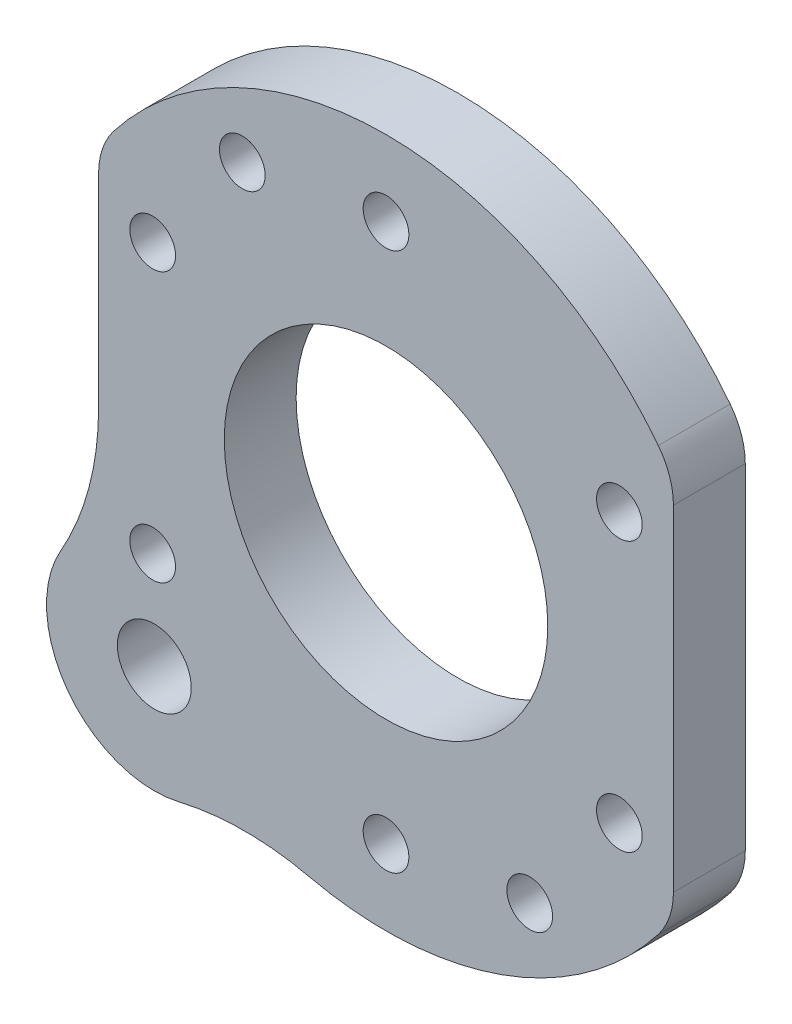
ISO-10303-21;
HEADER;
FILE_DESCRIPTION(('STEP AP214'),'2;1');
FILE_NAME('part.step','',(''),(''),'','','');
FILE_SCHEMA(('AUTOMOTIVE_DESIGN { 1 0 10303 214 1 1 1 1 }'));
ENDSEC;
DATA;
#1=APPLICATION_CONTEXT('core data for automotive mechanical design processes');
#2=APPLICATION_PROTOCOL_DEFINITION('international standard','automotive_design',2000,#1);
#3=PRODUCT_CONTEXT('',#1,'mechanical');
#4=PRODUCT('Part','Part','',(#3));
#5=PRODUCT_RELATED_PRODUCT_CATEGORY('part','',(#4));
#6=PRODUCT_DEFINITION_FORMATION('','',#4);
#7=PRODUCT_DEFINITION_CONTEXT('part definition',#1,'design');
#8=PRODUCT_DEFINITION('design','',#6,#7);
#9=PRODUCT_DEFINITION_SHAPE('','',#8);
#10=(LENGTH_UNIT() NAMED_UNIT(*) SI_UNIT(.MILLI.,.METRE.));
#11=(NAMED_UNIT(*) PLANE_ANGLE_UNIT() SI_UNIT($,.RADIAN.));
#12=(NAMED_UNIT(*) SI_UNIT($,.STERADIAN.) SOLID_ANGLE_UNIT());
#13=UNCERTAINTY_MEASURE_WITH_UNIT(LENGTH_MEASURE(1.E-05),#10,'distance_accuracy_value','');
#14=(GEOMETRIC_REPRESENTATION_CONTEXT(3) GLOBAL_UNCERTAINTY_ASSIGNED_CONTEXT((#13)) GLOBAL_UNIT_ASSIGNED_CONTEXT((#10,
#11,#12)) REPRESENTATION_CONTEXT('',''));
#15=CARTESIAN_POINT('',(0.,0.,0.));
#16=DIRECTION('',(0.,0.,1.));
#17=DIRECTION('',(1.,0.,0.));
#18=AXIS2_PLACEMENT_3D('',#15,#16,#17);
#19=CARTESIAN_POINT('',(25.4,0.,6.35));
#20=DIRECTION('',(1.,0.,0.));
#21=DIRECTION('',(0.,1.,0.));
#22=AXIS2_PLACEMENT_3D('',#19,#20,#21);
#23=PLANE('',#22);
#24=DIRECTION('',(0.,-1.,0.));
#25=VECTOR('',#24,1.);
#26=CARTESIAN_POINT('',(25.4,0.,0.));
#27=LINE('',#26,#25);
#28=CARTESIAN_POINT('',(25.4,14.8106178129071,0.));
#29=VERTEX_POINT('',#28);
#30=CARTESIAN_POINT('',(25.4,-14.8106178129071,0.));
#31=VERTEX_POINT('',#30);
#32=EDGE_CURVE('E143',#29,#31,#27,.T.);
#33=ORIENTED_EDGE('',*,*,#32,.F.);
#34=DIRECTION('',(0.,0.,1.));
#35=VECTOR('',#34,1.);
#36=CARTESIAN_POINT('',(25.4,14.8106178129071,6.35));
#37=LINE('',#36,#35);
#38=CARTESIAN_POINT('',(25.4,14.8106178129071,6.35));
#39=VERTEX_POINT('',#38);
#40=EDGE_CURVE('E121',#29,#39,#37,.T.);
#41=ORIENTED_EDGE('',*,*,#40,.T.);
#42=DIRECTION('',(0.,-1.,0.));
#43=VECTOR('',#42,1.);
#44=CARTESIAN_POINT('',(25.4,0.,6.35));
#45=LINE('',#44,#43);
#46=CARTESIAN_POINT('',(25.4,-14.8106178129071,6.35));
#47=VERTEX_POINT('',#46);
#48=EDGE_CURVE('E149',#39,#47,#45,.T.);
#49=ORIENTED_EDGE('',*,*,#48,.T.);
#50=DIRECTION('',(0.,0.,1.));
#51=VECTOR('',#50,1.);
#52=CARTESIAN_POINT('',(25.4,-14.8106178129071,0.));
#53=LINE('',#52,#51);
#54=EDGE_CURVE('E125',#47,#31,#53,.F.);
#55=ORIENTED_EDGE('',*,*,#54,.T.);
#56=EDGE_LOOP('',(#33,#41,#49,#55));
#57=FACE_BOUND('',#56,.T.);
#58=ADVANCED_FACE('F39',(#57),#23,.T.);
#59=CARTESIAN_POINT('',(0.,0.,6.35));
#60=DIRECTION('',(0.,0.,-1.));
#61=DIRECTION('',(-1.,0.,0.));
#62=AXIS2_PLACEMENT_3D('',#59,#60,#61);
#63=CYLINDRICAL_SURFACE('',#62,30.48);
#64=CARTESIAN_POINT('',(0.,0.,6.35));
#65=DIRECTION('',(0.,0.,1.));
#66=DIRECTION('',(1.,0.,0.));
#67=AXIS2_PLACEMENT_3D('',#64,#65,#66);
#68=CIRCLE('',#67,30.48);
#69=CARTESIAN_POINT('',(24.0631578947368,18.7081488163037,6.35));
#70=VERTEX_POINT('',#69);
#71=CARTESIAN_POINT('',(-24.0631578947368,18.7081488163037,6.35));
#72=VERTEX_POINT('',#71);
#73=EDGE_CURVE('E135',#70,#72,#68,.T.);
#74=ORIENTED_EDGE('',*,*,#73,.F.);
#75=DIRECTION('',(0.,0.,-1.));
#76=VECTOR('',#75,1.);
#77=CARTESIAN_POINT('',(24.0631578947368,18.7081488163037,6.35));
#78=LINE('',#77,#76);
#79=CARTESIAN_POINT('',(24.0631578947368,18.7081488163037,0.));
#80=VERTEX_POINT('',#79);
#81=EDGE_CURVE('E120',#70,#80,#78,.T.);
#82=ORIENTED_EDGE('',*,*,#81,.T.);
#83=CARTESIAN_POINT('',(0.,0.,0.));
#84=DIRECTION('',(0.,0.,1.));
#85=DIRECTION('',(1.,0.,0.));
#86=AXIS2_PLACEMENT_3D('',#83,#84,#85);
#87=CIRCLE('',#86,30.48);
#88=CARTESIAN_POINT('',(-24.0631578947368,18.7081488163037,0.));
#89=VERTEX_POINT('',#88);
#90=EDGE_CURVE('E132',#80,#89,#87,.T.);
#91=ORIENTED_EDGE('',*,*,#90,.T.);
#92=DIRECTION('',(0.,0.,-1.));
#93=VECTOR('',#92,1.);
#94=CARTESIAN_POINT('',(-24.0631578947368,18.7081488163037,6.35));
#95=LINE('',#94,#93);
#96=EDGE_CURVE('E137',#89,#72,#95,.F.);
#97=ORIENTED_EDGE('',*,*,#96,.T.);
#98=EDGE_LOOP('',(#74,#82,#91,#97));
#99=FACE_BOUND('',#98,.T.);
#100=ADVANCED_FACE('F131',(#99),#63,.T.);
#101=CARTESIAN_POINT('',(-25.4,0.,6.35));
#102=DIRECTION('',(1.,0.,0.));
#103=DIRECTION('',(0.,0.,-1.));
#104=AXIS2_PLACEMENT_3D('',#101,#102,#103);
#105=PLANE('',#104);
#106=DIRECTION('',(0.,-1.,0.));
#107=VECTOR('',#106,1.);
#108=CARTESIAN_POINT('',(-25.4,0.,0.));
#109=LINE('',#108,#107);
#110=CARTESIAN_POINT('',(-25.4,14.8106178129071,0.));
#111=VERTEX_POINT('',#110);
#112=CARTESIAN_POINT('',(-25.4,-3.15017437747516,0.));
#113=VERTEX_POINT('',#112);
#114=EDGE_CURVE('E142',#111,#113,#109,.T.);
#115=ORIENTED_EDGE('',*,*,#114,.T.);
#116=DIRECTION('',(0.,0.,-1.));
#117=VECTOR('',#116,1.);
#118=CARTESIAN_POINT('',(-25.4,-3.15017437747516,6.35));
#119=LINE('',#118,#117);
#120=CARTESIAN_POINT('',(-25.4,-3.15017437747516,6.35));
#121=VERTEX_POINT('',#120);
#122=EDGE_CURVE('E54',#113,#121,#119,.F.);
#123=ORIENTED_EDGE('',*,*,#122,.T.);
#124=DIRECTION('',(0.,-1.,0.));
#125=VECTOR('',#124,1.);
#126=CARTESIAN_POINT('',(-25.4,0.,6.35));
#127=LINE('',#126,#125);
#128=CARTESIAN_POINT('',(-25.4,14.8106178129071,6.35));
#129=VERTEX_POINT('',#128);
#130=EDGE_CURVE('E160',#129,#121,#127,.T.);
#131=ORIENTED_EDGE('',*,*,#130,.F.);
#132=DIRECTION('',(0.,0.,-1.));
#133=VECTOR('',#132,1.);
#134=CARTESIAN_POINT('',(-25.4,14.8106178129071,6.35));
#135=LINE('',#134,#133);
#136=EDGE_CURVE('E186',#129,#111,#135,.T.);
#137=ORIENTED_EDGE('',*,*,#136,.T.);
#138=EDGE_LOOP('',(#115,#123,#131,#137));
#139=FACE_BOUND('',#138,.T.);
#140=ADVANCED_FACE('F271',(#139),#105,.F.);
#141=CARTESIAN_POINT('',(-6.80256189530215,-29.7112024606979,6.35));
#142=VERTEX_POINT('',#141);
#143=CARTESIAN_POINT('',(24.0631578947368,-18.7081488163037,6.35));
#144=VERTEX_POINT('',#143);
#145=EDGE_CURVE('E162',#142,#144,#68,.T.);
#146=ORIENTED_EDGE('',*,*,#145,.F.);
#147=DIRECTION('',(0.,0.,-1.));
#148=VECTOR('',#147,1.);
#149=CARTESIAN_POINT('',(-6.80256189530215,-29.7112024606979,6.35));
#150=LINE('',#149,#148);
#151=CARTESIAN_POINT('',(-6.80256189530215,-29.7112024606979,0.));
#152=VERTEX_POINT('',#151);
#153=EDGE_CURVE('E183',#142,#152,#150,.T.);
#154=ORIENTED_EDGE('',*,*,#153,.T.);
#155=CARTESIAN_POINT('',(24.0631578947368,-18.7081488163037,0.));
#156=VERTEX_POINT('',#155);
#157=EDGE_CURVE('E145',#152,#156,#87,.T.);
#158=ORIENTED_EDGE('',*,*,#157,.T.);
#159=DIRECTION('',(0.,0.,-1.));
#160=VECTOR('',#159,1.);
#161=CARTESIAN_POINT('',(24.0631578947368,-18.7081488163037,6.35));
#162=LINE('',#161,#160);
#163=EDGE_CURVE('E202',#156,#144,#162,.F.);
#164=ORIENTED_EDGE('',*,*,#163,.T.);
#165=EDGE_LOOP('',(#146,#154,#158,#164));
#166=FACE_BOUND('',#165,.T.);
#167=ADVANCED_FACE('F200',(#166),#63,.T.);
#168=CARTESIAN_POINT('',(0.,0.,6.35));
#169=DIRECTION('',(0.,0.,1.));
#170=DIRECTION('',(1.,0.,0.));
#171=AXIS2_PLACEMENT_3D('',#168,#169,#170);
#172=PLANE('',#171);
#173=CARTESIAN_POINT('',(-12.7,21.9970452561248,6.35));
#174=DIRECTION('',(0.,0.,1.));
#175=DIRECTION('',(1.,0.,0.));
#176=AXIS2_PLACEMENT_3D('',#173,#174,#175);
#177=CIRCLE('',#176,2.01929999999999);
#178=CARTESIAN_POINT('',(-10.6807,21.9970452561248,6.35));
#179=VERTEX_POINT('',#178);
#180=EDGE_CURVE('E334',#179,#179,#177,.T.);
#181=ORIENTED_EDGE('',*,*,#180,.F.);
#182=EDGE_LOOP('',(#181));
#183=FACE_BOUND('',#182,.T.);
#184=CARTESIAN_POINT('',(12.7,-21.9970452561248,6.35));
#185=DIRECTION('',(0.,0.,1.));
#186=DIRECTION('',(1.,0.,0.));
#187=AXIS2_PLACEMENT_3D('',#184,#185,#186);
#188=CIRCLE('',#187,2.01929999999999);
#189=CARTESIAN_POINT('',(14.7192999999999,-21.9970452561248,6.35));
#190=VERTEX_POINT('',#189);
#191=EDGE_CURVE('E338',#190,#190,#188,.T.);
#192=ORIENTED_EDGE('',*,*,#191,.F.);
#193=EDGE_LOOP('',(#192));
#194=FACE_BOUND('',#193,.T.);
#195=CARTESIAN_POINT('',(0.,0.,6.35));
#196=DIRECTION('',(0.,0.,1.));
#197=DIRECTION('',(1.,0.,0.));
#198=AXIS2_PLACEMENT_3D('',#195,#196,#197);
#199=CIRCLE('',#198,14.29385);
#200=CARTESIAN_POINT('',(14.29385,0.,6.35));
#201=VERTEX_POINT('',#200);
#202=EDGE_CURVE('E342',#201,#201,#199,.T.);
#203=ORIENTED_EDGE('',*,*,#202,.F.);
#204=EDGE_LOOP('',(#203));
#205=FACE_BOUND('',#204,.T.);
#206=CARTESIAN_POINT('',(-20.4749839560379,-20.4749839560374,6.35));
#207=DIRECTION('',(0.,0.,-1.));
#208=DIRECTION('',(-1.,0.,0.));
#209=AXIS2_PLACEMENT_3D('',#206,#207,#208);
#210=CIRCLE('',#209,3.2639);
#211=CARTESIAN_POINT('',(-23.7388839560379,-20.4749839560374,6.35));
#212=VERTEX_POINT('',#211);
#213=EDGE_CURVE('E207',#212,#212,#210,.T.);
#214=ORIENTED_EDGE('',*,*,#213,.T.);
#215=EDGE_LOOP('',(#214));
#216=FACE_BOUND('',#215,.T.);
#217=CARTESIAN_POINT('',(-20.4749839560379,-20.4749839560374,6.35));
#218=DIRECTION('',(0.,0.,-1.));
#219=DIRECTION('',(-1.,0.,0.));
#220=AXIS2_PLACEMENT_3D('',#217,#218,#219);
#221=CIRCLE('',#220,9.525);
#222=CARTESIAN_POINT('',(-18.2921783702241,-29.7464986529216,6.35));
#223=VERTEX_POINT('',#222);
#224=CARTESIAN_POINT('',(-28.7454428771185,-15.7500358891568,6.35));
#225=VERTEX_POINT('',#224);
#226=EDGE_CURVE('E196',#223,#225,#221,.T.);
#227=ORIENTED_EDGE('',*,*,#226,.F.);
#228=CARTESIAN_POINT('',(-12.4713634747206,-54.4705378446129,6.35));
#229=DIRECTION('',(0.,0.,1.));
#230=DIRECTION('',(1.,0.,0.));
#231=AXIS2_PLACEMENT_3D('',#228,#229,#230);
#232=CIRCLE('',#231,25.4);
#233=EDGE_CURVE('E193',#223,#142,#232,.F.);
#234=ORIENTED_EDGE('',*,*,#233,.T.);
#235=ORIENTED_EDGE('',*,*,#145,.T.);
#236=CARTESIAN_POINT('',(19.05,-14.8106178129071,6.35));
#237=DIRECTION('',(0.,0.,1.));
#238=DIRECTION('',(1.,0.,0.));
#239=AXIS2_PLACEMENT_3D('',#236,#237,#238);
#240=CIRCLE('',#239,6.35);
#241=EDGE_CURVE('E509',#144,#47,#240,.T.);
#242=ORIENTED_EDGE('',*,*,#241,.T.);
#243=ORIENTED_EDGE('',*,*,#48,.F.);
#244=CARTESIAN_POINT('',(19.05,14.8106178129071,6.35));
#245=DIRECTION('',(0.,0.,1.));
#246=DIRECTION('',(1.,0.,0.));
#247=AXIS2_PLACEMENT_3D('',#244,#245,#246);
#248=CIRCLE('',#247,6.35);
#249=EDGE_CURVE('E505',#39,#70,#248,.T.);
#250=ORIENTED_EDGE('',*,*,#249,.T.);
#251=ORIENTED_EDGE('',*,*,#73,.T.);
#252=CARTESIAN_POINT('',(-19.05,14.8106178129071,6.35));
#253=DIRECTION('',(0.,0.,1.));
#254=DIRECTION('',(1.,0.,0.));
#255=AXIS2_PLACEMENT_3D('',#252,#253,#254);
#256=CIRCLE('',#255,6.35);
#257=EDGE_CURVE('E173',#72,#129,#256,.T.);
#258=ORIENTED_EDGE('',*,*,#257,.T.);
#259=ORIENTED_EDGE('',*,*,#130,.T.);
#260=CARTESIAN_POINT('',(-50.8,-3.15017437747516,6.35));
#261=DIRECTION('',(0.,0.,1.));
#262=DIRECTION('',(1.,0.,0.));
#263=AXIS2_PLACEMENT_3D('',#260,#261,#262);
#264=CIRCLE('',#263,25.4);
#265=EDGE_CURVE('E11',#121,#225,#264,.F.);
#266=ORIENTED_EDGE('',*,*,#265,.T.);
#267=EDGE_LOOP('',(#227,#234,#235,#242,#243,#250,#251,#258,#259,#266));
#268=FACE_BOUND('',#267,.T.);
#269=CARTESIAN_POINT('',(-20.6222299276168,11.9062500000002,6.35));
#270=DIRECTION('',(0.,0.,1.));
#271=DIRECTION('',(1.,0.,0.));
#272=AXIS2_PLACEMENT_3D('',#269,#270,#271);
#273=CIRCLE('',#272,2.01929999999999);
#274=CARTESIAN_POINT('',(-18.6029299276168,11.9062500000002,6.35));
#275=VERTEX_POINT('',#274);
#276=EDGE_CURVE('E209',#275,#275,#273,.T.);
#277=ORIENTED_EDGE('',*,*,#276,.F.);
#278=EDGE_LOOP('',(#277));
#279=FACE_BOUND('',#278,.T.);
#280=CARTESIAN_POINT('',(-20.6222299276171,-11.9062499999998,6.35));
#281=DIRECTION('',(0.,0.,1.));
#282=DIRECTION('',(1.,0.,0.));
#283=AXIS2_PLACEMENT_3D('',#280,#281,#282);
#284=CIRCLE('',#283,2.01929999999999);
#285=CARTESIAN_POINT('',(-18.6029299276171,-11.9062499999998,6.35));
#286=VERTEX_POINT('',#285);
#287=EDGE_CURVE('E220',#286,#286,#284,.T.);
#288=ORIENTED_EDGE('',*,*,#287,.F.);
#289=EDGE_LOOP('',(#288));
#290=FACE_BOUND('',#289,.T.);
#291=CARTESIAN_POINT('',(0.,-23.8125,6.35));
#292=DIRECTION('',(0.,0.,1.));
#293=DIRECTION('',(1.,0.,0.));
#294=AXIS2_PLACEMENT_3D('',#291,#292,#293);
#295=CIRCLE('',#294,2.01929999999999);
#296=CARTESIAN_POINT('',(2.01929999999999,-23.8125,6.35));
#297=VERTEX_POINT('',#296);
#298=EDGE_CURVE('E226',#297,#297,#295,.T.);
#299=ORIENTED_EDGE('',*,*,#298,.F.);
#300=EDGE_LOOP('',(#299));
#301=FACE_BOUND('',#300,.T.);
#302=CARTESIAN_POINT('',(20.6222299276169,-11.9062500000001,6.35));
#303=DIRECTION('',(0.,0.,1.));
#304=DIRECTION('',(1.,0.,0.));
#305=AXIS2_PLACEMENT_3D('',#302,#303,#304);
#306=CIRCLE('',#305,2.01929999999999);
#307=CARTESIAN_POINT('',(22.6415299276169,-11.9062500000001,6.35));
#308=VERTEX_POINT('',#307);
#309=EDGE_CURVE('E232',#308,#308,#306,.T.);
#310=ORIENTED_EDGE('',*,*,#309,.F.);
#311=EDGE_LOOP('',(#310));
#312=FACE_BOUND('',#311,.T.);
#313=CARTESIAN_POINT('',(20.622229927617,11.90625,6.35));
#314=DIRECTION('',(0.,0.,1.));
#315=DIRECTION('',(1.,0.,0.));
#316=AXIS2_PLACEMENT_3D('',#313,#314,#315);
#317=CIRCLE('',#316,2.01929999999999);
#318=CARTESIAN_POINT('',(22.641529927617,11.90625,6.35));
#319=VERTEX_POINT('',#318);
#320=EDGE_CURVE('E238',#319,#319,#317,.T.);
#321=ORIENTED_EDGE('',*,*,#320,.F.);
#322=EDGE_LOOP('',(#321));
#323=FACE_BOUND('',#322,.T.);
#324=CARTESIAN_POINT('',(0.,23.8125,6.35));
#325=DIRECTION('',(0.,0.,1.));
#326=DIRECTION('',(1.,0.,0.));
#327=AXIS2_PLACEMENT_3D('',#324,#325,#326);
#328=CIRCLE('',#327,2.01929999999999);
#329=CARTESIAN_POINT('',(2.01929999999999,23.8125,6.35));
#330=VERTEX_POINT('',#329);
#331=EDGE_CURVE('E243',#330,#330,#328,.T.);
#332=ORIENTED_EDGE('',*,*,#331,.F.);
#333=EDGE_LOOP('',(#332));
#334=FACE_BOUND('',#333,.T.);
#335=ADVANCED_FACE('F169',(#183,#194,#205,#216,#268,#279,#290,#301,#312,#323,#334),#172,.T.);
#336=CARTESIAN_POINT('',(0.,0.,0.));
#337=DIRECTION('',(0.,0.,1.));
#338=DIRECTION('',(1.,0.,0.));
#339=AXIS2_PLACEMENT_3D('',#336,#337,#338);
#340=PLANE('',#339);
#341=CARTESIAN_POINT('',(-12.7,21.9970452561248,0.));
#342=DIRECTION('',(0.,0.,1.));
#343=DIRECTION('',(1.,0.,0.));
#344=AXIS2_PLACEMENT_3D('',#341,#342,#343);
#345=CIRCLE('',#344,2.0193);
#346=CARTESIAN_POINT('',(-10.6807,21.9970452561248,0.));
#347=VERTEX_POINT('',#346);
#348=EDGE_CURVE('E357',#347,#347,#345,.T.);
#349=ORIENTED_EDGE('',*,*,#348,.T.);
#350=EDGE_LOOP('',(#349));
#351=FACE_BOUND('',#350,.T.);
#352=CARTESIAN_POINT('',(12.7,-21.9970452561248,0.));
#353=DIRECTION('',(0.,0.,1.));
#354=DIRECTION('',(1.,0.,0.));
#355=AXIS2_PLACEMENT_3D('',#352,#353,#354);
#356=CIRCLE('',#355,2.0193);
#357=CARTESIAN_POINT('',(14.7193,-21.9970452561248,0.));
#358=VERTEX_POINT('',#357);
#359=EDGE_CURVE('E345',#358,#358,#356,.T.);
#360=ORIENTED_EDGE('',*,*,#359,.T.);
#361=EDGE_LOOP('',(#360));
#362=FACE_BOUND('',#361,.T.);
#363=CARTESIAN_POINT('',(0.,0.,0.));
#364=DIRECTION('',(0.,0.,1.));
#365=DIRECTION('',(1.,0.,0.));
#366=AXIS2_PLACEMENT_3D('',#363,#364,#365);
#367=CIRCLE('',#366,14.29385);
#368=CARTESIAN_POINT('',(14.29385,0.,0.));
#369=VERTEX_POINT('',#368);
#370=EDGE_CURVE('E344',#369,#369,#367,.T.);
#371=ORIENTED_EDGE('',*,*,#370,.T.);
#372=EDGE_LOOP('',(#371));
#373=FACE_BOUND('',#372,.T.);
#374=CARTESIAN_POINT('',(-20.4749839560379,-20.4749839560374,0.));
#375=DIRECTION('',(0.,0.,-1.));
#376=DIRECTION('',(-1.,0.,0.));
#377=AXIS2_PLACEMENT_3D('',#374,#375,#376);
#378=CIRCLE('',#377,3.2639);
#379=CARTESIAN_POINT('',(-23.7388839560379,-20.4749839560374,0.));
#380=VERTEX_POINT('',#379);
#381=EDGE_CURVE('E212',#380,#380,#378,.T.);
#382=ORIENTED_EDGE('',*,*,#381,.F.);
#383=EDGE_LOOP('',(#382));
#384=FACE_BOUND('',#383,.T.);
#385=ORIENTED_EDGE('',*,*,#157,.F.);
#386=CARTESIAN_POINT('',(-12.4713634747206,-54.4705378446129,0.));
#387=DIRECTION('',(0.,0.,1.));
#388=DIRECTION('',(1.,0.,0.));
#389=AXIS2_PLACEMENT_3D('',#386,#387,#388);
#390=CIRCLE('',#389,25.4);
#391=CARTESIAN_POINT('',(-18.2921783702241,-29.7464986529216,0.));
#392=VERTEX_POINT('',#391);
#393=EDGE_CURVE('E191',#152,#392,#390,.T.);
#394=ORIENTED_EDGE('',*,*,#393,.T.);
#395=CARTESIAN_POINT('',(-20.4749839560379,-20.4749839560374,0.));
#396=DIRECTION('',(0.,0.,-1.));
#397=DIRECTION('',(-1.,0.,0.));
#398=AXIS2_PLACEMENT_3D('',#395,#396,#397);
#399=CIRCLE('',#398,9.525);
#400=CARTESIAN_POINT('',(-28.7454428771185,-15.7500358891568,0.));
#401=VERTEX_POINT('',#400);
#402=EDGE_CURVE('E205',#392,#401,#399,.T.);
#403=ORIENTED_EDGE('',*,*,#402,.T.);
#404=CARTESIAN_POINT('',(-50.8,-3.15017437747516,0.));
#405=DIRECTION('',(0.,0.,1.));
#406=DIRECTION('',(1.,0.,0.));
#407=AXIS2_PLACEMENT_3D('',#404,#405,#406);
#408=CIRCLE('',#407,25.4);
#409=EDGE_CURVE('E47',#401,#113,#408,.T.);
#410=ORIENTED_EDGE('',*,*,#409,.T.);
#411=ORIENTED_EDGE('',*,*,#114,.F.);
#412=CARTESIAN_POINT('',(-19.05,14.8106178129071,0.));
#413=DIRECTION('',(0.,0.,1.));
#414=DIRECTION('',(1.,0.,0.));
#415=AXIS2_PLACEMENT_3D('',#412,#413,#414);
#416=CIRCLE('',#415,6.35);
#417=EDGE_CURVE('E136',#111,#89,#416,.F.);
#418=ORIENTED_EDGE('',*,*,#417,.T.);
#419=ORIENTED_EDGE('',*,*,#90,.F.);
#420=CARTESIAN_POINT('',(19.05,14.8106178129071,0.));
#421=DIRECTION('',(0.,0.,1.));
#422=DIRECTION('',(1.,0.,0.));
#423=AXIS2_PLACEMENT_3D('',#420,#421,#422);
#424=CIRCLE('',#423,6.35);
#425=EDGE_CURVE('E116',#80,#29,#424,.F.);
#426=ORIENTED_EDGE('',*,*,#425,.T.);
#427=ORIENTED_EDGE('',*,*,#32,.T.);
#428=CARTESIAN_POINT('',(19.05,-14.8106178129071,0.));
#429=DIRECTION('',(0.,0.,1.));
#430=DIRECTION('',(1.,0.,0.));
#431=AXIS2_PLACEMENT_3D('',#428,#429,#430);
#432=CIRCLE('',#431,6.35);
#433=EDGE_CURVE('E126',#31,#156,#432,.F.);
#434=ORIENTED_EDGE('',*,*,#433,.T.);
#435=EDGE_LOOP('',(#385,#394,#403,#410,#411,#418,#419,#426,#427,#434));
#436=FACE_BOUND('',#435,.T.);
#437=CARTESIAN_POINT('',(-20.6222299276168,11.9062500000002,0.));
#438=DIRECTION('',(0.,0.,1.));
#439=DIRECTION('',(1.,0.,0.));
#440=AXIS2_PLACEMENT_3D('',#437,#438,#439);
#441=CIRCLE('',#440,2.0193);
#442=CARTESIAN_POINT('',(-18.6029299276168,11.9062500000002,0.));
#443=VERTEX_POINT('',#442);
#444=EDGE_CURVE('E217',#443,#443,#441,.T.);
#445=ORIENTED_EDGE('',*,*,#444,.T.);
#446=EDGE_LOOP('',(#445));
#447=FACE_BOUND('',#446,.T.);
#448=CARTESIAN_POINT('',(-20.6222299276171,-11.9062499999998,0.));
#449=DIRECTION('',(0.,0.,1.));
#450=DIRECTION('',(1.,0.,0.));
#451=AXIS2_PLACEMENT_3D('',#448,#449,#450);
#452=CIRCLE('',#451,2.0193);
#453=CARTESIAN_POINT('',(-18.6029299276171,-11.9062499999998,0.));
#454=VERTEX_POINT('',#453);
#455=EDGE_CURVE('E223',#454,#454,#452,.T.);
#456=ORIENTED_EDGE('',*,*,#455,.T.);
#457=EDGE_LOOP('',(#456));
#458=FACE_BOUND('',#457,.T.);
#459=CARTESIAN_POINT('',(0.,-23.8125,0.));
#460=DIRECTION('',(0.,0.,1.));
#461=DIRECTION('',(1.,0.,0.));
#462=AXIS2_PLACEMENT_3D('',#459,#460,#461);
#463=CIRCLE('',#462,2.0193);
#464=CARTESIAN_POINT('',(2.0193,-23.8125,0.));
#465=VERTEX_POINT('',#464);
#466=EDGE_CURVE('E229',#465,#465,#463,.T.);
#467=ORIENTED_EDGE('',*,*,#466,.T.);
#468=EDGE_LOOP('',(#467));
#469=FACE_BOUND('',#468,.T.);
#470=CARTESIAN_POINT('',(20.6222299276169,-11.9062500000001,0.));
#471=DIRECTION('',(0.,0.,1.));
#472=DIRECTION('',(1.,0.,0.));
#473=AXIS2_PLACEMENT_3D('',#470,#471,#472);
#474=CIRCLE('',#473,2.0193);
#475=CARTESIAN_POINT('',(22.6415299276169,-11.9062500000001,0.));
#476=VERTEX_POINT('',#475);
#477=EDGE_CURVE('E235',#476,#476,#474,.T.);
#478=ORIENTED_EDGE('',*,*,#477,.T.);
#479=EDGE_LOOP('',(#478));
#480=FACE_BOUND('',#479,.T.);
#481=CARTESIAN_POINT('',(20.622229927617,11.90625,0.));
#482=DIRECTION('',(0.,0.,1.));
#483=DIRECTION('',(1.,0.,0.));
#484=AXIS2_PLACEMENT_3D('',#481,#482,#483);
#485=CIRCLE('',#484,2.0193);
#486=CARTESIAN_POINT('',(22.641529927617,11.90625,0.));
#487=VERTEX_POINT('',#486);
#488=EDGE_CURVE('E241',#487,#487,#485,.T.);
#489=ORIENTED_EDGE('',*,*,#488,.T.);
#490=EDGE_LOOP('',(#489));
#491=FACE_BOUND('',#490,.T.);
#492=CARTESIAN_POINT('',(0.,23.8125,0.));
#493=DIRECTION('',(0.,0.,1.));
#494=DIRECTION('',(1.,0.,0.));
#495=AXIS2_PLACEMENT_3D('',#492,#493,#494);
#496=CIRCLE('',#495,2.0193);
#497=CARTESIAN_POINT('',(2.0193,23.8125,0.));
#498=VERTEX_POINT('',#497);
#499=EDGE_CURVE('E147',#498,#498,#496,.T.);
#500=ORIENTED_EDGE('',*,*,#499,.T.);
#501=EDGE_LOOP('',(#500));
#502=FACE_BOUND('',#501,.T.);
#503=ADVANCED_FACE('F140',(#351,#362,#373,#384,#436,#447,#458,#469,#480,#491,#502),#340,.F.);
#504=CARTESIAN_POINT('',(0.,23.8125,6.35));
#505=DIRECTION('',(0.,0.,1.));
#506=DIRECTION('',(1.,0.,0.));
#507=AXIS2_PLACEMENT_3D('',#504,#505,#506);
#508=CYLINDRICAL_SURFACE('',#507,2.01929999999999);
#509=ORIENTED_EDGE('',*,*,#499,.F.);
#510=EDGE_LOOP('',(#509));
#511=FACE_BOUND('',#510,.T.);
#512=ORIENTED_EDGE('',*,*,#331,.T.);
#513=EDGE_LOOP('',(#512));
#514=FACE_BOUND('',#513,.T.);
#515=ADVANCED_FACE('F251',(#511,#514),#508,.F.);
#516=CARTESIAN_POINT('',(20.622229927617,11.90625,6.35));
#517=DIRECTION('',(0.,0.,1.));
#518=DIRECTION('',(1.,0.,0.));
#519=AXIS2_PLACEMENT_3D('',#516,#517,#518);
#520=CYLINDRICAL_SURFACE('',#519,2.01929999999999);
#521=ORIENTED_EDGE('',*,*,#488,.F.);
#522=EDGE_LOOP('',(#521));
#523=FACE_BOUND('',#522,.T.);
#524=ORIENTED_EDGE('',*,*,#320,.T.);
#525=EDGE_LOOP('',(#524));
#526=FACE_BOUND('',#525,.T.);
#527=ADVANCED_FACE('F253',(#523,#526),#520,.F.);
#528=CARTESIAN_POINT('',(20.6222299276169,-11.9062500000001,6.35));
#529=DIRECTION('',(0.,0.,1.));
#530=DIRECTION('',(1.,0.,0.));
#531=AXIS2_PLACEMENT_3D('',#528,#529,#530);
#532=CYLINDRICAL_SURFACE('',#531,2.01929999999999);
#533=ORIENTED_EDGE('',*,*,#477,.F.);
#534=EDGE_LOOP('',(#533));
#535=FACE_BOUND('',#534,.T.);
#536=ORIENTED_EDGE('',*,*,#309,.T.);
#537=EDGE_LOOP('',(#536));
#538=FACE_BOUND('',#537,.T.);
#539=ADVANCED_FACE('F259',(#535,#538),#532,.F.);
#540=CARTESIAN_POINT('',(0.,-23.8125,6.35));
#541=DIRECTION('',(0.,0.,1.));
#542=DIRECTION('',(1.,0.,0.));
#543=AXIS2_PLACEMENT_3D('',#540,#541,#542);
#544=CYLINDRICAL_SURFACE('',#543,2.01929999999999);
#545=ORIENTED_EDGE('',*,*,#466,.F.);
#546=EDGE_LOOP('',(#545));
#547=FACE_BOUND('',#546,.T.);
#548=ORIENTED_EDGE('',*,*,#298,.T.);
#549=EDGE_LOOP('',(#548));
#550=FACE_BOUND('',#549,.T.);
#551=ADVANCED_FACE('F309',(#547,#550),#544,.F.);
#552=CARTESIAN_POINT('',(-20.6222299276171,-11.9062499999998,6.35));
#553=DIRECTION('',(0.,0.,1.));
#554=DIRECTION('',(1.,0.,0.));
#555=AXIS2_PLACEMENT_3D('',#552,#553,#554);
#556=CYLINDRICAL_SURFACE('',#555,2.01929999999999);
#557=ORIENTED_EDGE('',*,*,#455,.F.);
#558=EDGE_LOOP('',(#557));
#559=FACE_BOUND('',#558,.T.);
#560=ORIENTED_EDGE('',*,*,#287,.T.);
#561=EDGE_LOOP('',(#560));
#562=FACE_BOUND('',#561,.T.);
#563=ADVANCED_FACE('F305',(#559,#562),#556,.F.);
#564=CARTESIAN_POINT('',(-20.6222299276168,11.9062500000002,6.35));
#565=DIRECTION('',(0.,0.,1.));
#566=DIRECTION('',(1.,0.,0.));
#567=AXIS2_PLACEMENT_3D('',#564,#565,#566);
#568=CYLINDRICAL_SURFACE('',#567,2.01929999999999);
#569=ORIENTED_EDGE('',*,*,#444,.F.);
#570=EDGE_LOOP('',(#569));
#571=FACE_BOUND('',#570,.T.);
#572=ORIENTED_EDGE('',*,*,#276,.T.);
#573=EDGE_LOOP('',(#572));
#574=FACE_BOUND('',#573,.T.);
#575=ADVANCED_FACE('F278',(#571,#574),#568,.F.);
#576=CARTESIAN_POINT('',(19.05,14.8106178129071,6.35));
#577=DIRECTION('',(0.,0.,-1.));
#578=DIRECTION('',(-1.,0.,0.));
#579=AXIS2_PLACEMENT_3D('',#576,#577,#578);
#580=CYLINDRICAL_SURFACE('',#579,6.35);
#581=ORIENTED_EDGE('',*,*,#249,.F.);
#582=ORIENTED_EDGE('',*,*,#40,.F.);
#583=ORIENTED_EDGE('',*,*,#425,.F.);
#584=ORIENTED_EDGE('',*,*,#81,.F.);
#585=EDGE_LOOP('',(#581,#582,#583,#584));
#586=FACE_BOUND('',#585,.T.);
#587=ADVANCED_FACE('F119',(#586),#580,.T.);
#588=CARTESIAN_POINT('',(19.05,-14.8106178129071,6.35));
#589=DIRECTION('',(0.,0.,-1.));
#590=DIRECTION('',(-1.,0.,0.));
#591=AXIS2_PLACEMENT_3D('',#588,#589,#590);
#592=CYLINDRICAL_SURFACE('',#591,6.35);
#593=ORIENTED_EDGE('',*,*,#241,.F.);
#594=ORIENTED_EDGE('',*,*,#163,.F.);
#595=ORIENTED_EDGE('',*,*,#433,.F.);
#596=ORIENTED_EDGE('',*,*,#54,.F.);
#597=EDGE_LOOP('',(#593,#594,#595,#596));
#598=FACE_BOUND('',#597,.T.);
#599=ADVANCED_FACE('F277',(#598),#592,.T.);
#600=CARTESIAN_POINT('',(-19.05,14.8106178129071,6.35));
#601=DIRECTION('',(0.,0.,-1.));
#602=DIRECTION('',(-1.,0.,0.));
#603=AXIS2_PLACEMENT_3D('',#600,#601,#602);
#604=CYLINDRICAL_SURFACE('',#603,6.35);
#605=ORIENTED_EDGE('',*,*,#257,.F.);
#606=ORIENTED_EDGE('',*,*,#96,.F.);
#607=ORIENTED_EDGE('',*,*,#417,.F.);
#608=ORIENTED_EDGE('',*,*,#136,.F.);
#609=EDGE_LOOP('',(#605,#606,#607,#608));
#610=FACE_BOUND('',#609,.T.);
#611=ADVANCED_FACE('F281',(#610),#604,.T.);
#612=CARTESIAN_POINT('',(-20.4749839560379,-20.4749839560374,6.35));
#613=DIRECTION('',(0.,0.,-1.));
#614=DIRECTION('',(-1.,0.,0.));
#615=AXIS2_PLACEMENT_3D('',#612,#613,#614);
#616=CYLINDRICAL_SURFACE('',#615,9.525);
#617=ORIENTED_EDGE('',*,*,#402,.F.);
#618=DIRECTION('',(0.,0.,-1.));
#619=VECTOR('',#618,1.);
#620=CARTESIAN_POINT('',(-18.2921783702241,-29.7464986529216,6.35));
#621=LINE('',#620,#619);
#622=EDGE_CURVE('E182',#392,#223,#621,.F.);
#623=ORIENTED_EDGE('',*,*,#622,.T.);
#624=ORIENTED_EDGE('',*,*,#226,.T.);
#625=DIRECTION('',(0.,0.,-1.));
#626=VECTOR('',#625,1.);
#627=CARTESIAN_POINT('',(-28.7454428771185,-15.7500358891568,6.35));
#628=LINE('',#627,#626);
#629=EDGE_CURVE('E179',#225,#401,#628,.T.);
#630=ORIENTED_EDGE('',*,*,#629,.T.);
#631=EDGE_LOOP('',(#617,#623,#624,#630));
#632=FACE_BOUND('',#631,.T.);
#633=ADVANCED_FACE('F206',(#632),#616,.T.);
#634=CARTESIAN_POINT('',(-20.4749839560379,-20.4749839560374,0.));
#635=DIRECTION('',(0.,0.,-1.));
#636=DIRECTION('',(-1.,0.,0.));
#637=AXIS2_PLACEMENT_3D('',#634,#635,#636);
#638=CYLINDRICAL_SURFACE('',#637,3.2639);
#639=ORIENTED_EDGE('',*,*,#213,.F.);
#640=EDGE_LOOP('',(#639));
#641=FACE_BOUND('',#640,.T.);
#642=ORIENTED_EDGE('',*,*,#381,.T.);
#643=EDGE_LOOP('',(#642));
#644=FACE_BOUND('',#643,.T.);
#645=ADVANCED_FACE('F286',(#641,#644),#638,.F.);
#646=CARTESIAN_POINT('',(-12.4713634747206,-54.4705378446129,6.35));
#647=DIRECTION('',(0.,0.,1.));
#648=DIRECTION('',(1.,0.,0.));
#649=AXIS2_PLACEMENT_3D('',#646,#647,#648);
#650=CYLINDRICAL_SURFACE('',#649,25.4);
#651=ORIENTED_EDGE('',*,*,#233,.F.);
#652=ORIENTED_EDGE('',*,*,#622,.F.);
#653=ORIENTED_EDGE('',*,*,#393,.F.);
#654=ORIENTED_EDGE('',*,*,#153,.F.);
#655=EDGE_LOOP('',(#651,#652,#653,#654));
#656=FACE_BOUND('',#655,.T.);
#657=ADVANCED_FACE('F204',(#656),#650,.F.);
#658=CARTESIAN_POINT('',(-50.8,-3.15017437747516,6.35));
#659=DIRECTION('',(0.,0.,-1.));
#660=DIRECTION('',(-1.,0.,0.));
#661=AXIS2_PLACEMENT_3D('',#658,#659,#660);
#662=CYLINDRICAL_SURFACE('',#661,25.4);
#663=ORIENTED_EDGE('',*,*,#265,.F.);
#664=ORIENTED_EDGE('',*,*,#122,.F.);
#665=ORIENTED_EDGE('',*,*,#409,.F.);
#666=ORIENTED_EDGE('',*,*,#629,.F.);
#667=EDGE_LOOP('',(#663,#664,#665,#666));
#668=FACE_BOUND('',#667,.T.);
#669=ADVANCED_FACE('F41',(#668),#662,.F.);
#670=CARTESIAN_POINT('',(0.,0.,0.));
#671=DIRECTION('',(0.,0.,1.));
#672=DIRECTION('',(1.,0.,0.));
#673=AXIS2_PLACEMENT_3D('',#670,#671,#672);
#674=CYLINDRICAL_SURFACE('',#673,14.29385);
#675=ORIENTED_EDGE('',*,*,#370,.F.);
#676=EDGE_LOOP('',(#675));
#677=FACE_BOUND('',#676,.T.);
#678=ORIENTED_EDGE('',*,*,#202,.T.);
#679=EDGE_LOOP('',(#678));
#680=FACE_BOUND('',#679,.T.);
#681=ADVANCED_FACE('F291',(#677,#680),#674,.F.);
#682=CARTESIAN_POINT('',(12.7,-21.9970452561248,6.35));
#683=DIRECTION('',(0.,0.,1.));
#684=DIRECTION('',(1.,0.,0.));
#685=AXIS2_PLACEMENT_3D('',#682,#683,#684);
#686=CYLINDRICAL_SURFACE('',#685,2.01929999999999);
#687=ORIENTED_EDGE('',*,*,#359,.F.);
#688=EDGE_LOOP('',(#687));
#689=FACE_BOUND('',#688,.T.);
#690=ORIENTED_EDGE('',*,*,#191,.T.);
#691=EDGE_LOOP('',(#690));
#692=FACE_BOUND('',#691,.T.);
#693=ADVANCED_FACE('F363',(#689,#692),#686,.F.);
#694=CARTESIAN_POINT('',(-12.7,21.9970452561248,6.35));
#695=DIRECTION('',(0.,0.,1.));
#696=DIRECTION('',(1.,0.,0.));
#697=AXIS2_PLACEMENT_3D('',#694,#695,#696);
#698=CYLINDRICAL_SURFACE('',#697,2.01929999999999);
#699=ORIENTED_EDGE('',*,*,#348,.F.);
#700=EDGE_LOOP('',(#699));
#701=FACE_BOUND('',#700,.T.);
#702=ORIENTED_EDGE('',*,*,#180,.T.);
#703=EDGE_LOOP('',(#702));
#704=FACE_BOUND('',#703,.T.);
#705=ADVANCED_FACE('F361',(#701,#704),#698,.F.);
#706=CLOSED_SHELL('',(#58,#100,#140,#167,#335,#503,#515,#527,#539,#551,#563,#575,#587,#599,#611,
#633,#645,#657,#669,#681,#693,#705));
#707=MANIFOLD_SOLID_BREP('B2',#706);
#708=ADVANCED_BREP_SHAPE_REPRESENTATION('',(#18,#707),#14);
#709=SHAPE_DEFINITION_REPRESENTATION(#9,#708);
ENDSEC;
END-ISO-10303-21;
